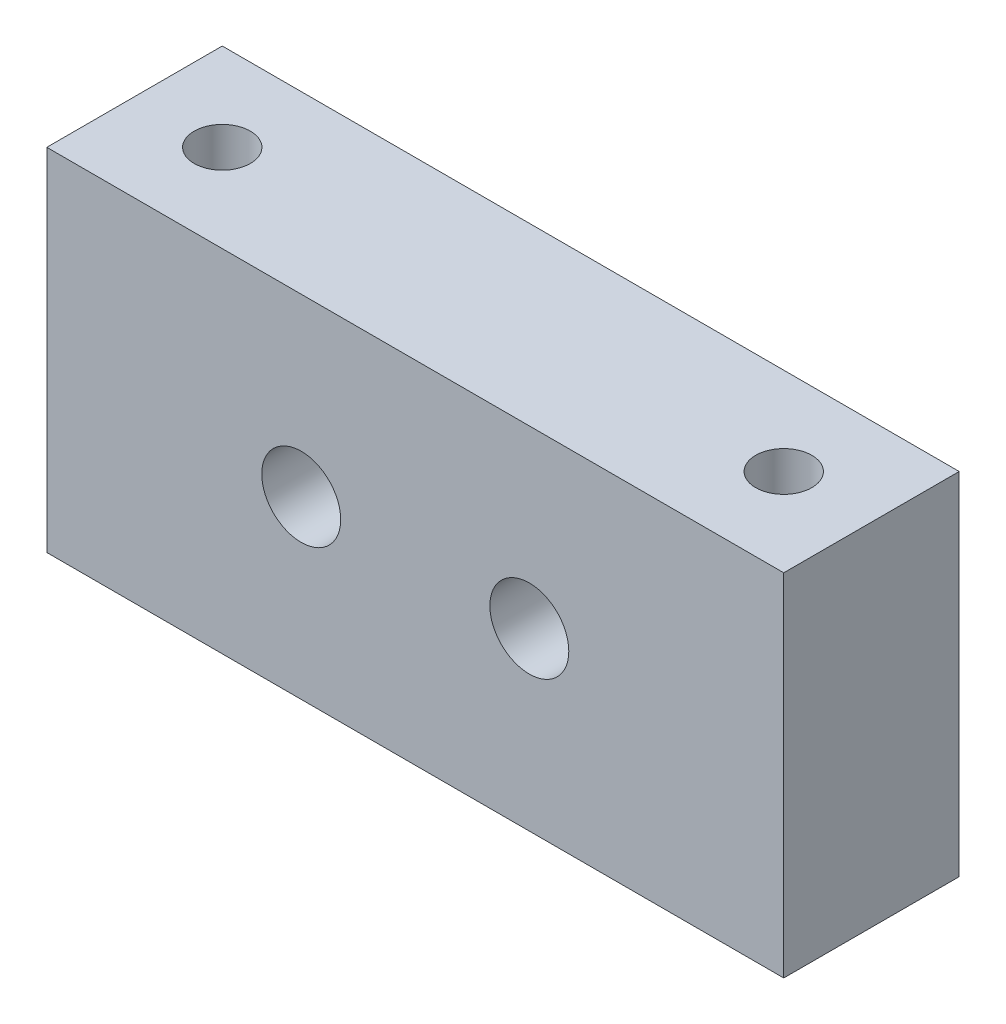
from build123d import *

# Parameters (mm, degrees)
CROQUIS1_W                      = 42
CROQUIS1_H                      = 20
SALIENTE_EXTRUIR1_DEPTH         = 10
CROQUIS2_R                      = 2.25
CORTAR_EXTRUIR1_DEPTH           = 10
CROQUIS3_R                      = 1.6
SCHNITT_LINEAR_AUSTRAGEN1_DEPTH = 20


with BuildPart() as part:
    # Croquis1 → Saliente-Extruir1 (new body)
    with BuildSketch(Plane.XY):
        Rectangle(CROQUIS1_W, CROQUIS1_H)
    extrude(amount=SALIENTE_EXTRUIR1_DEPTH)

    # Croquis2 → Cortar-Extruir1 (cut)
    with BuildSketch(Plane.XY.offset(10)):
        with Locations((-6.5, 0)):
            Circle(CROQUIS2_R)
        with Locations((6.5, 0)):
            Circle(CROQUIS2_R)
    extrude(amount=-CORTAR_EXTRUIR1_DEPTH, mode=Mode.SUBTRACT)

    # Croquis3 → Schnitt-Linear austragen1 (cut)
    with BuildSketch(Plane(origin=(0, 10, 0), x_dir=(1, 0, 0), z_dir=(0, 1, 0))):
        with Locations(Location((-16, -5, 0), (0, 0, 270))):
            Circle(CROQUIS3_R)
        with Locations(Location((16, -5, 0), (0, 0, 270))):
            Circle(CROQUIS3_R)
    extrude(amount=-SCHNITT_LINEAR_AUSTRAGEN1_DEPTH, mode=Mode.SUBTRACT)


solid = part.part
